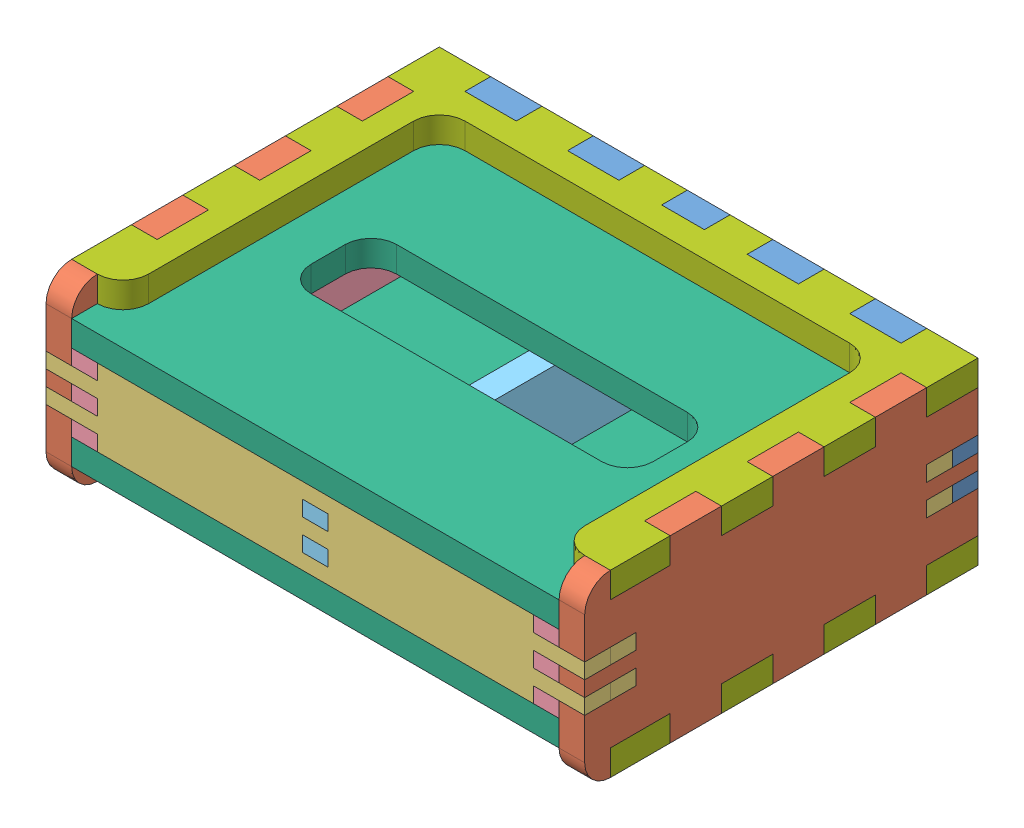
SolidWorks assembly SD Holder Assembily.SLDASM, configuration Default (file format 4400). Lengths in mm.
Overall size (63 21 46).
13 component instances, 7 part files, 33 mates.
Components (placement in the parent):
- Back Plate 1-1: Back Plate 1.SLDPRT [Default] at (-0.015 4.7402 -3.2125) size (63 21 3)
- Side Plate 1-1: Side Plate 1.SLDPRT [Default] at (-31.515 4.7402 19.7875) size (3 21 46)
- Side Plate 1-2: Side Plate 1.SLDPRT [Default] at (28.485 4.7402 19.7875) size (3 21 46)
- Front Plate 1-1: Front Plate 1.SLDPRT [Default] at (-0.015 4.7402 36.7875) size (63 9 3)
- Front Plate 1-2: Front Plate 1.SLDPRT [Default] at (-0.015 4.7402 39.7875) size (63 9 3)
- Front Plate 1-3: Front Plate 1.SLDPRT [Default] at (-0.015 4.7402 -0.2125) size (63 9 3)
- Side Plate 2-1: Side Plate 2.SLDPRT [Default] at (-28.515 4.7402 19.7875) size (3 9 46)
- Side Plate 2-2: Side Plate 2.SLDPRT [Default] at (25.485 4.7402 19.7875) size (3 9 46)
- Divider-1: Divider.SLDPRT [Default] at (-1.515 4.7402 19.7875) size (3 9 46)
- Top-1: Top.SLDPRT [Default] at (-0.015 9.2402 21.2875) size (57 3 43)
- Top-2: Top.SLDPRT [Default] at (-0.015 -2.7598 21.2875) size (57 3 43)
- Top Clip-1: Top Clip.SLDPRT [Default] at (-0.015 12.2402 18.2875) size (63 3 43)
- Top Clip-2: Top Clip.SLDPRT [Default] at (-0.015 -5.7598 18.2875) size (63 3 43)
Mates (geometry in assembly coordinates):
- Coincident1: coincident aligned: plane of Back Plate 1-1 through (31.485 15.2402 -3.2125) normal (0 0 -1); plane of Side Plate 1-1 through (-28.515 -5.7598 -3.2125) normal (0 0 -1)
- Coincident2: coincident aligned: plane of Back Plate 1-1 through (31.485 15.2402 -3.2125) normal (0 0 -1); plane of Side Plate 1-2 through (31.485 -5.7598 -3.2125) normal (0 0 -1)
- Coincident3: coincident aligned: plane of Back Plate 1-1 through (31.485 -5.7598 -0.2125) normal (1 0 0); plane of Side Plate 1-2 through (31.485 15.2402 -3.2125) normal (1 0 0)
- Coincident4: coincident aligned: plane of Back Plate 1-1 through (-31.515 -5.7598 -0.2125) normal (-1 0 0); plane of Side Plate 1-1 through (-31.515 15.2402 -3.2125) normal (-1 0 0)
- Coincident5: coincident aligned: plane of Back Plate 1-1 through (-31.515 -5.7598 -0.2125) normal (0 -1 0); plane of Side Plate 1-1 through (-28.515 -5.7598 42.7875) normal (0 -1 0)
- Coincident6: coincident aligned: plane of Back Plate 1-1 through (-31.515 -5.7598 -0.2125) normal (0 -1 0); plane of Side Plate 1-2 through (31.485 -5.7598 42.7875) normal (0 -1 0)
- Coincident7: coincident aligned: plane of Side Plate 1-2 through (31.485 15.2402 -3.2125) normal (1 0 0); plane of Front Plate 1-2 through (31.485 0.2402 42.7875) normal (1 0 0)
- Coincident8: coincident aligned: plane of Side Plate 1-2 through (31.485 -5.7598 42.7875) normal (0 0 1); plane of Front Plate 1-2 through (31.485 9.2402 42.7875) normal (0 0 1)
- Distance1: distance = 6 mm aligned: plane of Front Plate 1-2 through (-31.515 9.2402 42.7875) normal (0 1 0); plane of Side Plate 1-2 through (31.485 15.2402 42.7875) normal (0 1 0)
- Coincident10: coincident aligned: plane of Front Plate 1-1 through (-31.515 9.2402 39.7875) normal (0 1 0); plane of Front Plate 1-2 through (-31.515 9.2402 42.7875) normal (0 1 0)
- Coincident11: coincident aligned: plane of Side Plate 1-2 through (31.485 15.2402 -3.2125) normal (1 0 0); plane of Front Plate 1-1 through (31.485 0.2402 39.7875) normal (1 0 0)
- Coincident12: coincident anti-aligned: plane of Front Plate 1-1 through (31.485 9.2402 39.7875) normal (0 0 1); plane of Front Plate 1-2 through (31.485 9.2402 39.7875) normal (0 0 -1)
- Coincident16: coincident anti-aligned: plane of Side Plate 1-1 through (-28.515 15.2402 -3.2125) normal (1 0 0); plane of Side Plate 2-1 through (-28.515 9.2402 -3.2125) normal (-1 0 0)
- Coincident17: coincident aligned: plane of Front Plate 1-2 through (31.485 9.2402 42.7875) normal (0 0 1); plane of Side Plate 2-1 through (-25.515 0.2402 42.7875) normal (0 0 1)
- Coincident20: coincident aligned: plane of Front Plate 1-2 through (31.485 9.2402 42.7875) normal (0 0 1); plane of Side Plate 2-2 through (28.485 0.2402 42.7875) normal (0 0 1)
- Coincident21: coincident anti-aligned: plane of Side Plate 1-2 through (28.485 15.2402 -3.2125) normal (-1 0 0); plane of Side Plate 2-2 through (28.485 9.2402 -3.2125) normal (1 0 0)
- Coincident22: coincident aligned: plane of Front Plate 1-2 through (31.485 9.2402 42.7875) normal (0 0 1); plane of Divider-1 through (1.485 0.2402 42.7875) normal (0 0 1)
- Distance3: distance = 24 mm anti-aligned: plane of Divider-1 through (1.485 9.2402 -3.2125) normal (1 0 0); plane of Side Plate 2-2 through (25.485 9.2402 -3.2125) normal (-1 0 0)
- Coincident25: coincident anti-aligned: plane of Side Plate 1-1 through (-28.515 15.2402 -3.2125) normal (1 0 0); plane of Top-1 through (-28.515 12.2402 42.7875) normal (-1 0 0)
- Coincident27: coincident aligned: plane of Front Plate 1-2 through (31.485 9.2402 42.7875) normal (0 0 1); plane of Top-1 through (-28.515 12.2402 42.7875) normal (0 0 1)
- Coincident28: coincident aligned: plane of Front Plate 1-2 through (31.485 9.2402 42.7875) normal (0 0 1); plane of Top-2 through (-28.515 0.2402 42.7875) normal (0 0 1)
- Coincident29: coincident anti-aligned: plane of Side Plate 1-2 through (28.485 15.2402 -3.2125) normal (-1 0 0); plane of Top-2 through (28.485 0.2402 42.7875) normal (1 0 0)
- Coincident31: coincident aligned: plane of Side Plate 1-1 through (-28.515 15.2402 42.7875) normal (0 1 0); plane of Top Clip-1 through (31.485 15.2402 -3.2125) normal (0 1 0)
- Coincident32: coincident aligned: plane of Side Plate 1-1 through (-31.515 15.2402 -3.2125) normal (-1 0 0); plane of Top Clip-1 through (-31.515 15.2402 39.7875) normal (-1 0 0)
- Coincident35: coincident aligned: plane of Side Plate 1-1 through (-31.515 15.2402 -3.2125) normal (-1 0 0); plane of Top Clip-2 through (-31.515 -2.7598 39.7875) normal (-1 0 0)
- Coincident36: coincident anti-aligned: plane of Top-2 through (28.485 -2.7598 -0.2125) normal (0 -1 0); plane of Top Clip-2 through (31.485 -2.7598 -3.2125) normal (0 1 0)
- Coincident37: coincident aligned: plane of Back Plate 1-1 through (31.485 15.2402 -3.2125) normal (0 0 -1); plane of Top Clip-1 through (-31.515 15.2402 -3.2125) normal (0 0 -1)
- Coincident38: coincident aligned: plane of Back Plate 1-1 through (31.485 15.2402 -3.2125) normal (0 0 -1); plane of Top Clip-2 through (-31.515 -2.7598 -3.2125) normal (0 0 -1)
- Coincident39: coincident aligned: plane of Front Plate 1-3 through (-31.515 9.2402 2.7875) normal (0 1 0); plane of Divider-1 through (1.485 9.2402 42.7875) normal (0 1 0)
- Coincident40: coincident aligned: plane of Front Plate 1-3 through (-31.515 9.2402 2.7875) normal (0 1 0); plane of Side Plate 2-2 through (28.485 9.2402 42.7875) normal (0 1 0)
- Coincident41: coincident anti-aligned: plane of Back Plate 1-1 through (31.485 15.2402 -0.2125) normal (0 0 1); plane of Front Plate 1-3 through (31.485 9.2402 -0.2125) normal (0 0 -1)
- Coincident42: coincident aligned: plane of Side Plate 1-1 through (-31.515 15.2402 -3.2125) normal (-1 0 0); plane of Front Plate 1-3 through (-31.515 0.2402 2.7875) normal (-1 0 0)
- Coincident43: coincident aligned: plane of Front Plate 1-1 through (-31.515 9.2402 39.7875) normal (0 1 0); plane of Side Plate 2-2 through (28.485 9.2402 42.7875) normal (0 1 0)
